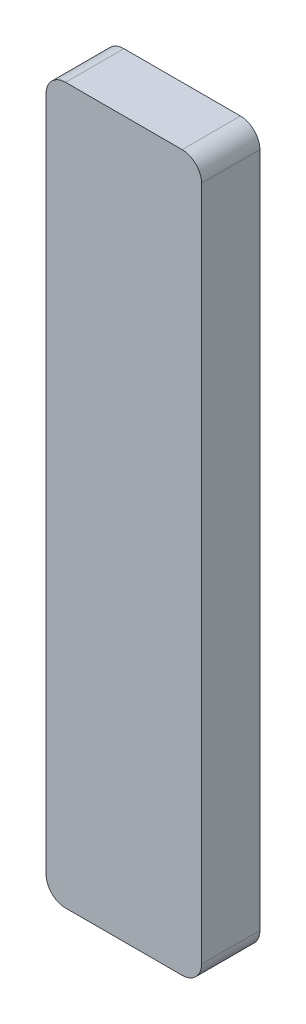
ISO-10303-21;
HEADER;
FILE_DESCRIPTION(('STEP AP214'),'2;1');
FILE_NAME('part.step','',(''),(''),'','','');
FILE_SCHEMA(('AUTOMOTIVE_DESIGN { 1 0 10303 214 1 1 1 1 }'));
ENDSEC;
DATA;
#1=APPLICATION_CONTEXT('core data for automotive mechanical design processes');
#2=APPLICATION_PROTOCOL_DEFINITION('international standard','automotive_design',2000,#1);
#3=PRODUCT_CONTEXT('',#1,'mechanical');
#4=PRODUCT('Part','Part','',(#3));
#5=PRODUCT_RELATED_PRODUCT_CATEGORY('part','',(#4));
#6=PRODUCT_DEFINITION_FORMATION('','',#4);
#7=PRODUCT_DEFINITION_CONTEXT('part definition',#1,'design');
#8=PRODUCT_DEFINITION('design','',#6,#7);
#9=PRODUCT_DEFINITION_SHAPE('','',#8);
#10=(LENGTH_UNIT() NAMED_UNIT(*) SI_UNIT(.MILLI.,.METRE.));
#11=(NAMED_UNIT(*) PLANE_ANGLE_UNIT() SI_UNIT($,.RADIAN.));
#12=(NAMED_UNIT(*) SI_UNIT($,.STERADIAN.) SOLID_ANGLE_UNIT());
#13=UNCERTAINTY_MEASURE_WITH_UNIT(LENGTH_MEASURE(1.E-05),#10,'distance_accuracy_value','');
#14=(GEOMETRIC_REPRESENTATION_CONTEXT(3) GLOBAL_UNCERTAINTY_ASSIGNED_CONTEXT((#13)) GLOBAL_UNIT_ASSIGNED_CONTEXT((#10,
#11,#12)) REPRESENTATION_CONTEXT('',''));
#15=CARTESIAN_POINT('',(0.,0.,0.));
#16=DIRECTION('',(0.,0.,1.));
#17=DIRECTION('',(1.,0.,0.));
#18=AXIS2_PLACEMENT_3D('',#15,#16,#17);
#19=CARTESIAN_POINT('',(3.,-17.4,3.));
#20=DIRECTION('',(0.,0.,-1.));
#21=DIRECTION('',(-1.,0.,0.));
#22=AXIS2_PLACEMENT_3D('',#19,#20,#21);
#23=CYLINDRICAL_SURFACE('',#22,0.999999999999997);
#24=CARTESIAN_POINT('',(3.,-17.4,0.));
#25=DIRECTION('',(0.,0.,1.));
#26=DIRECTION('',(1.,0.,0.));
#27=AXIS2_PLACEMENT_3D('',#24,#25,#26);
#28=CIRCLE('',#27,0.999999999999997);
#29=CARTESIAN_POINT('',(3.,-18.4,0.));
#30=VERTEX_POINT('',#29);
#31=CARTESIAN_POINT('',(3.99999999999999,-17.4,0.));
#32=VERTEX_POINT('',#31);
#33=EDGE_CURVE('E129',#30,#32,#28,.T.);
#34=ORIENTED_EDGE('',*,*,#33,.T.);
#35=DIRECTION('',(0.,0.,-1.));
#36=VECTOR('',#35,1.);
#37=CARTESIAN_POINT('',(3.99999999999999,-17.4,3.));
#38=LINE('',#37,#36);
#39=CARTESIAN_POINT('',(3.99999999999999,-17.4,3.));
#40=VERTEX_POINT('',#39);
#41=EDGE_CURVE('E11',#40,#32,#38,.T.);
#42=ORIENTED_EDGE('',*,*,#41,.F.);
#43=CARTESIAN_POINT('',(3.,-17.4,3.));
#44=DIRECTION('',(0.,0.,1.));
#45=DIRECTION('',(1.,0.,0.));
#46=AXIS2_PLACEMENT_3D('',#43,#44,#45);
#47=CIRCLE('',#46,0.999999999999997);
#48=CARTESIAN_POINT('',(3.,-18.4,3.));
#49=VERTEX_POINT('',#48);
#50=EDGE_CURVE('E143',#49,#40,#47,.T.);
#51=ORIENTED_EDGE('',*,*,#50,.F.);
#52=DIRECTION('',(0.,0.,-1.));
#53=VECTOR('',#52,1.);
#54=CARTESIAN_POINT('',(3.,-18.4,3.));
#55=LINE('',#54,#53);
#56=EDGE_CURVE('E125',#49,#30,#55,.T.);
#57=ORIENTED_EDGE('',*,*,#56,.T.);
#58=EDGE_LOOP('',(#34,#42,#51,#57));
#59=FACE_BOUND('',#58,.T.);
#60=ADVANCED_FACE('F33',(#59),#23,.T.);
#61=CARTESIAN_POINT('',(3.99999999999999,17.4,3.));
#62=DIRECTION('',(-1.,0.,0.));
#63=DIRECTION('',(0.,-1.,0.));
#64=AXIS2_PLACEMENT_3D('',#61,#62,#63);
#65=PLANE('',#64);
#66=DIRECTION('',(0.,1.,0.));
#67=VECTOR('',#66,1.);
#68=CARTESIAN_POINT('',(3.99999999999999,17.4,0.));
#69=LINE('',#68,#67);
#70=CARTESIAN_POINT('',(3.99999999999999,17.4,0.));
#71=VERTEX_POINT('',#70);
#72=EDGE_CURVE('E132',#32,#71,#69,.T.);
#73=ORIENTED_EDGE('',*,*,#72,.T.);
#74=DIRECTION('',(0.,0.,-1.));
#75=VECTOR('',#74,1.);
#76=CARTESIAN_POINT('',(3.99999999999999,17.4,3.));
#77=LINE('',#76,#75);
#78=CARTESIAN_POINT('',(3.99999999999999,17.4,3.));
#79=VERTEX_POINT('',#78);
#80=EDGE_CURVE('E41',#79,#71,#77,.T.);
#81=ORIENTED_EDGE('',*,*,#80,.F.);
#82=DIRECTION('',(0.,1.,0.));
#83=VECTOR('',#82,1.);
#84=CARTESIAN_POINT('',(3.99999999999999,17.4,3.));
#85=LINE('',#84,#83);
#86=EDGE_CURVE('E92',#40,#79,#85,.T.);
#87=ORIENTED_EDGE('',*,*,#86,.F.);
#88=ORIENTED_EDGE('',*,*,#41,.T.);
#89=EDGE_LOOP('',(#73,#81,#87,#88));
#90=FACE_BOUND('',#89,.T.);
#91=ADVANCED_FACE('F178',(#90),#65,.F.);
#92=CARTESIAN_POINT('',(3.,17.4,3.));
#93=DIRECTION('',(0.,0.,-1.));
#94=DIRECTION('',(-1.,0.,0.));
#95=AXIS2_PLACEMENT_3D('',#92,#93,#94);
#96=CYLINDRICAL_SURFACE('',#95,0.999999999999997);
#97=CARTESIAN_POINT('',(3.,17.4,0.));
#98=DIRECTION('',(0.,0.,1.));
#99=DIRECTION('',(1.,0.,0.));
#100=AXIS2_PLACEMENT_3D('',#97,#98,#99);
#101=CIRCLE('',#100,0.999999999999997);
#102=CARTESIAN_POINT('',(3.,18.4,0.));
#103=VERTEX_POINT('',#102);
#104=EDGE_CURVE('E134',#71,#103,#101,.T.);
#105=ORIENTED_EDGE('',*,*,#104,.T.);
#106=DIRECTION('',(0.,0.,-1.));
#107=VECTOR('',#106,1.);
#108=CARTESIAN_POINT('',(3.,18.4,3.));
#109=LINE('',#108,#107);
#110=CARTESIAN_POINT('',(3.,18.4,3.));
#111=VERTEX_POINT('',#110);
#112=EDGE_CURVE('E150',#111,#103,#109,.T.);
#113=ORIENTED_EDGE('',*,*,#112,.F.);
#114=CARTESIAN_POINT('',(3.,17.4,3.));
#115=DIRECTION('',(0.,0.,1.));
#116=DIRECTION('',(1.,0.,0.));
#117=AXIS2_PLACEMENT_3D('',#114,#115,#116);
#118=CIRCLE('',#117,0.999999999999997);
#119=EDGE_CURVE('E158',#79,#111,#118,.T.);
#120=ORIENTED_EDGE('',*,*,#119,.F.);
#121=ORIENTED_EDGE('',*,*,#80,.T.);
#122=EDGE_LOOP('',(#105,#113,#120,#121));
#123=FACE_BOUND('',#122,.T.);
#124=ADVANCED_FACE('F156',(#123),#96,.T.);
#125=CARTESIAN_POINT('',(3.,18.4,3.));
#126=DIRECTION('',(0.,-1.,0.));
#127=DIRECTION('',(0.,0.,-1.));
#128=AXIS2_PLACEMENT_3D('',#125,#126,#127);
#129=PLANE('',#128);
#130=DIRECTION('',(-1.,0.,0.));
#131=VECTOR('',#130,1.);
#132=CARTESIAN_POINT('',(3.,18.4,0.));
#133=LINE('',#132,#131);
#134=CARTESIAN_POINT('',(-3.,18.4,0.));
#135=VERTEX_POINT('',#134);
#136=EDGE_CURVE('E136',#103,#135,#133,.T.);
#137=ORIENTED_EDGE('',*,*,#136,.T.);
#138=DIRECTION('',(0.,0.,-1.));
#139=VECTOR('',#138,1.);
#140=CARTESIAN_POINT('',(-3.,18.4,3.));
#141=LINE('',#140,#139);
#142=CARTESIAN_POINT('',(-3.,18.4,3.));
#143=VERTEX_POINT('',#142);
#144=EDGE_CURVE('E147',#143,#135,#141,.T.);
#145=ORIENTED_EDGE('',*,*,#144,.F.);
#146=DIRECTION('',(-1.,0.,0.));
#147=VECTOR('',#146,1.);
#148=CARTESIAN_POINT('',(3.,18.4,3.));
#149=LINE('',#148,#147);
#150=EDGE_CURVE('E170',#111,#143,#149,.T.);
#151=ORIENTED_EDGE('',*,*,#150,.F.);
#152=ORIENTED_EDGE('',*,*,#112,.T.);
#153=EDGE_LOOP('',(#137,#145,#151,#152));
#154=FACE_BOUND('',#153,.T.);
#155=ADVANCED_FACE('F166',(#154),#129,.F.);
#156=CARTESIAN_POINT('',(-3.,17.4,3.));
#157=DIRECTION('',(0.,0.,-1.));
#158=DIRECTION('',(-1.,0.,0.));
#159=AXIS2_PLACEMENT_3D('',#156,#157,#158);
#160=CYLINDRICAL_SURFACE('',#159,0.999999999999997);
#161=CARTESIAN_POINT('',(-3.,17.4,0.));
#162=DIRECTION('',(0.,0.,1.));
#163=DIRECTION('',(-1.,0.,0.));
#164=AXIS2_PLACEMENT_3D('',#161,#162,#163);
#165=CIRCLE('',#164,0.999999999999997);
#166=CARTESIAN_POINT('',(-3.99999999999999,17.4,0.));
#167=VERTEX_POINT('',#166);
#168=EDGE_CURVE('E138',#135,#167,#165,.T.);
#169=ORIENTED_EDGE('',*,*,#168,.T.);
#170=DIRECTION('',(0.,0.,-1.));
#171=VECTOR('',#170,1.);
#172=CARTESIAN_POINT('',(-3.99999999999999,17.4,3.));
#173=LINE('',#172,#171);
#174=CARTESIAN_POINT('',(-3.99999999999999,17.4,3.));
#175=VERTEX_POINT('',#174);
#176=EDGE_CURVE('E120',#175,#167,#173,.T.);
#177=ORIENTED_EDGE('',*,*,#176,.F.);
#178=CARTESIAN_POINT('',(-3.,17.4,3.));
#179=DIRECTION('',(0.,0.,1.));
#180=DIRECTION('',(-1.,0.,0.));
#181=AXIS2_PLACEMENT_3D('',#178,#179,#180);
#182=CIRCLE('',#181,0.999999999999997);
#183=EDGE_CURVE('E111',#143,#175,#182,.T.);
#184=ORIENTED_EDGE('',*,*,#183,.F.);
#185=ORIENTED_EDGE('',*,*,#144,.T.);
#186=EDGE_LOOP('',(#169,#177,#184,#185));
#187=FACE_BOUND('',#186,.T.);
#188=ADVANCED_FACE('F169',(#187),#160,.T.);
#189=CARTESIAN_POINT('',(-3.99999999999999,17.4,3.));
#190=DIRECTION('',(1.,0.,0.));
#191=DIRECTION('',(0.,1.,0.));
#192=AXIS2_PLACEMENT_3D('',#189,#190,#191);
#193=PLANE('',#192);
#194=DIRECTION('',(0.,-1.,0.));
#195=VECTOR('',#194,1.);
#196=CARTESIAN_POINT('',(-3.99999999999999,17.4,0.));
#197=LINE('',#196,#195);
#198=CARTESIAN_POINT('',(-4.,-17.4,0.));
#199=VERTEX_POINT('',#198);
#200=EDGE_CURVE('E119',#167,#199,#197,.T.);
#201=ORIENTED_EDGE('',*,*,#200,.T.);
#202=DIRECTION('',(0.,0.,-1.));
#203=VECTOR('',#202,1.);
#204=CARTESIAN_POINT('',(-4.,-17.4,3.));
#205=LINE('',#204,#203);
#206=CARTESIAN_POINT('',(-4.,-17.4,3.));
#207=VERTEX_POINT('',#206);
#208=EDGE_CURVE('E116',#207,#199,#205,.T.);
#209=ORIENTED_EDGE('',*,*,#208,.F.);
#210=DIRECTION('',(0.,-1.,0.));
#211=VECTOR('',#210,1.);
#212=CARTESIAN_POINT('',(-3.99999999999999,17.4,3.));
#213=LINE('',#212,#211);
#214=EDGE_CURVE('E105',#175,#207,#213,.T.);
#215=ORIENTED_EDGE('',*,*,#214,.F.);
#216=ORIENTED_EDGE('',*,*,#176,.T.);
#217=EDGE_LOOP('',(#201,#209,#215,#216));
#218=FACE_BOUND('',#217,.T.);
#219=ADVANCED_FACE('F117',(#218),#193,.F.);
#220=CARTESIAN_POINT('',(-3.,-17.4,3.));
#221=DIRECTION('',(0.,0.,-1.));
#222=DIRECTION('',(-1.,0.,0.));
#223=AXIS2_PLACEMENT_3D('',#220,#221,#222);
#224=CYLINDRICAL_SURFACE('',#223,0.999999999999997);
#225=CARTESIAN_POINT('',(-3.,-17.4,0.));
#226=DIRECTION('',(0.,0.,1.));
#227=DIRECTION('',(-1.,0.,0.));
#228=AXIS2_PLACEMENT_3D('',#225,#226,#227);
#229=CIRCLE('',#228,0.999999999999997);
#230=CARTESIAN_POINT('',(-2.99999999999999,-18.4,0.));
#231=VERTEX_POINT('',#230);
#232=EDGE_CURVE('E78',#199,#231,#229,.T.);
#233=ORIENTED_EDGE('',*,*,#232,.T.);
#234=DIRECTION('',(0.,0.,-1.));
#235=VECTOR('',#234,1.);
#236=CARTESIAN_POINT('',(-2.99999999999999,-18.4,3.));
#237=LINE('',#236,#235);
#238=CARTESIAN_POINT('',(-2.99999999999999,-18.4,3.));
#239=VERTEX_POINT('',#238);
#240=EDGE_CURVE('E121',#239,#231,#237,.T.);
#241=ORIENTED_EDGE('',*,*,#240,.F.);
#242=CARTESIAN_POINT('',(-3.,-17.4,3.));
#243=DIRECTION('',(0.,0.,1.));
#244=DIRECTION('',(-1.,0.,0.));
#245=AXIS2_PLACEMENT_3D('',#242,#243,#244);
#246=CIRCLE('',#245,0.999999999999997);
#247=EDGE_CURVE('E109',#207,#239,#246,.T.);
#248=ORIENTED_EDGE('',*,*,#247,.F.);
#249=ORIENTED_EDGE('',*,*,#208,.T.);
#250=EDGE_LOOP('',(#233,#241,#248,#249));
#251=FACE_BOUND('',#250,.T.);
#252=ADVANCED_FACE('F123',(#251),#224,.T.);
#253=CARTESIAN_POINT('',(3.,-18.4,3.));
#254=DIRECTION('',(0.,1.,0.));
#255=DIRECTION('',(0.,0.,1.));
#256=AXIS2_PLACEMENT_3D('',#253,#254,#255);
#257=PLANE('',#256);
#258=DIRECTION('',(1.,0.,0.));
#259=VECTOR('',#258,1.);
#260=CARTESIAN_POINT('',(3.,-18.4,0.));
#261=LINE('',#260,#259);
#262=EDGE_CURVE('E84',#231,#30,#261,.T.);
#263=ORIENTED_EDGE('',*,*,#262,.T.);
#264=ORIENTED_EDGE('',*,*,#56,.F.);
#265=DIRECTION('',(1.,0.,0.));
#266=VECTOR('',#265,1.);
#267=CARTESIAN_POINT('',(3.,-18.4,3.));
#268=LINE('',#267,#266);
#269=EDGE_CURVE('E49',#239,#49,#268,.T.);
#270=ORIENTED_EDGE('',*,*,#269,.F.);
#271=ORIENTED_EDGE('',*,*,#240,.T.);
#272=EDGE_LOOP('',(#263,#264,#270,#271));
#273=FACE_BOUND('',#272,.T.);
#274=ADVANCED_FACE('F194',(#273),#257,.F.);
#275=CARTESIAN_POINT('',(3.,-17.4,3.));
#276=DIRECTION('',(0.,0.,1.));
#277=DIRECTION('',(1.,0.,0.));
#278=AXIS2_PLACEMENT_3D('',#275,#276,#277);
#279=PLANE('',#278);
#280=ORIENTED_EDGE('',*,*,#50,.T.);
#281=ORIENTED_EDGE('',*,*,#86,.T.);
#282=ORIENTED_EDGE('',*,*,#119,.T.);
#283=ORIENTED_EDGE('',*,*,#150,.T.);
#284=ORIENTED_EDGE('',*,*,#183,.T.);
#285=ORIENTED_EDGE('',*,*,#214,.T.);
#286=ORIENTED_EDGE('',*,*,#247,.T.);
#287=ORIENTED_EDGE('',*,*,#269,.T.);
#288=EDGE_LOOP('',(#280,#281,#282,#283,#284,#285,#286,#287));
#289=FACE_BOUND('',#288,.T.);
#290=ADVANCED_FACE('F107',(#289),#279,.T.);
#291=CARTESIAN_POINT('',(3.,-17.4,0.));
#292=DIRECTION('',(0.,0.,1.));
#293=DIRECTION('',(1.,0.,0.));
#294=AXIS2_PLACEMENT_3D('',#291,#292,#293);
#295=PLANE('',#294);
#296=ORIENTED_EDGE('',*,*,#33,.F.);
#297=ORIENTED_EDGE('',*,*,#262,.F.);
#298=ORIENTED_EDGE('',*,*,#232,.F.);
#299=ORIENTED_EDGE('',*,*,#200,.F.);
#300=ORIENTED_EDGE('',*,*,#168,.F.);
#301=ORIENTED_EDGE('',*,*,#136,.F.);
#302=ORIENTED_EDGE('',*,*,#104,.F.);
#303=ORIENTED_EDGE('',*,*,#72,.F.);
#304=EDGE_LOOP('',(#296,#297,#298,#299,#300,#301,#302,#303));
#305=FACE_BOUND('',#304,.T.);
#306=ADVANCED_FACE('F162',(#305),#295,.F.);
#307=CLOSED_SHELL('',(#60,#91,#124,#155,#188,#219,#252,#274,#290,#306));
#308=MANIFOLD_SOLID_BREP('B2',#307);
#309=ADVANCED_BREP_SHAPE_REPRESENTATION('',(#18,#308),#14);
#310=SHAPE_DEFINITION_REPRESENTATION(#9,#309);
ENDSEC;
END-ISO-10303-21;
